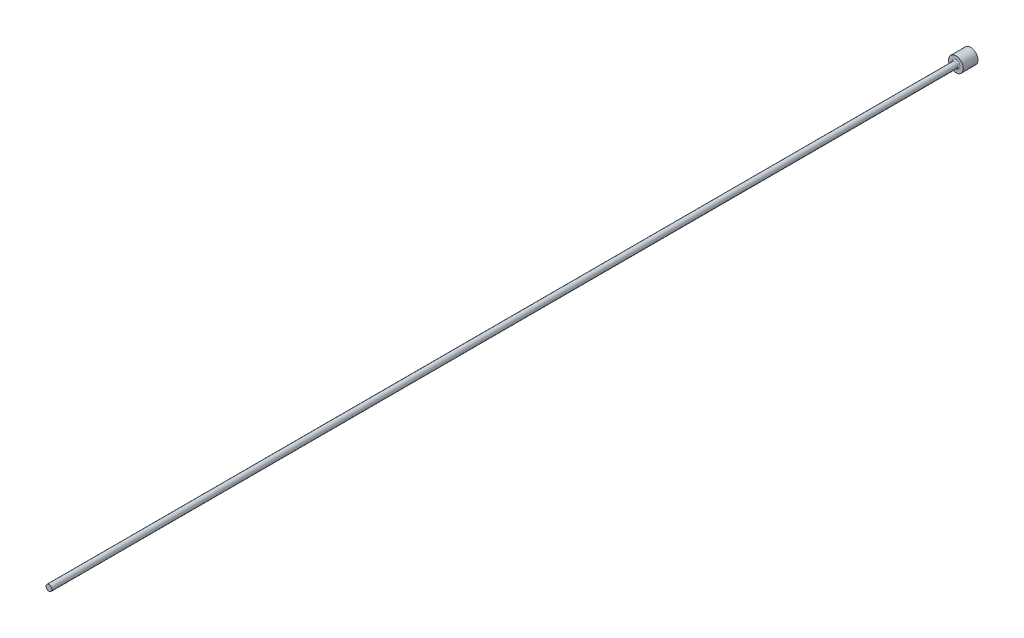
ISO-10303-21;
HEADER;
FILE_DESCRIPTION(('STEP AP214'),'2;1');
FILE_NAME('part.step','',(''),(''),'','','');
FILE_SCHEMA(('AUTOMOTIVE_DESIGN { 1 0 10303 214 1 1 1 1 }'));
ENDSEC;
DATA;
#1=APPLICATION_CONTEXT('core data for automotive mechanical design processes');
#2=APPLICATION_PROTOCOL_DEFINITION('international standard','automotive_design',2000,#1);
#3=PRODUCT_CONTEXT('',#1,'mechanical');
#4=PRODUCT('Part','Part','',(#3));
#5=PRODUCT_RELATED_PRODUCT_CATEGORY('part','',(#4));
#6=PRODUCT_DEFINITION_FORMATION('','',#4);
#7=PRODUCT_DEFINITION_CONTEXT('part definition',#1,'design');
#8=PRODUCT_DEFINITION('design','',#6,#7);
#9=PRODUCT_DEFINITION_SHAPE('','',#8);
#10=(LENGTH_UNIT() NAMED_UNIT(*) SI_UNIT(.MILLI.,.METRE.));
#11=(NAMED_UNIT(*) PLANE_ANGLE_UNIT() SI_UNIT($,.RADIAN.));
#12=(NAMED_UNIT(*) SI_UNIT($,.STERADIAN.) SOLID_ANGLE_UNIT());
#13=UNCERTAINTY_MEASURE_WITH_UNIT(LENGTH_MEASURE(1.E-05),#10,'distance_accuracy_value','');
#14=(GEOMETRIC_REPRESENTATION_CONTEXT(3) GLOBAL_UNCERTAINTY_ASSIGNED_CONTEXT((#13)) GLOBAL_UNIT_ASSIGNED_CONTEXT((#10,
#11,#12)) REPRESENTATION_CONTEXT('',''));
#15=CARTESIAN_POINT('',(0.,0.,0.));
#16=DIRECTION('',(0.,0.,1.));
#17=DIRECTION('',(1.,0.,0.));
#18=AXIS2_PLACEMENT_3D('',#15,#16,#17);
#19=CARTESIAN_POINT('',(2.,0.,4.));
#20=DIRECTION('',(0.,0.,-1.));
#21=DIRECTION('',(-1.,0.,0.));
#22=AXIS2_PLACEMENT_3D('',#19,#20,#21);
#23=PLANE('',#22);
#24=CARTESIAN_POINT('',(0.,0.,4.));
#25=DIRECTION('',(0.,0.,-1.));
#26=DIRECTION('',(-1.,0.,0.));
#27=AXIS2_PLACEMENT_3D('',#24,#25,#26);
#28=CIRCLE('',#27,1.10000000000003);
#29=CARTESIAN_POINT('',(-1.10000000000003,0.,4.));
#30=VERTEX_POINT('',#29);
#31=EDGE_CURVE('E40',#30,#30,#28,.T.);
#32=ORIENTED_EDGE('',*,*,#31,.T.);
#33=EDGE_LOOP('',(#32));
#34=FACE_BOUND('',#33,.T.);
#35=CARTESIAN_POINT('',(0.,0.,4.));
#36=DIRECTION('',(0.,0.,-1.));
#37=DIRECTION('',(-1.,0.,0.));
#38=AXIS2_PLACEMENT_3D('',#35,#36,#37);
#39=CIRCLE('',#38,2.);
#40=CARTESIAN_POINT('',(-2.,0.,4.));
#41=VERTEX_POINT('',#40);
#42=EDGE_CURVE('E44',#41,#41,#39,.T.);
#43=ORIENTED_EDGE('',*,*,#42,.F.);
#44=EDGE_LOOP('',(#43));
#45=FACE_BOUND('',#44,.T.);
#46=ADVANCED_FACE('F33',(#34,#45),#23,.F.);
#47=CARTESIAN_POINT('',(0.,0.,-9.03322817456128));
#48=DIRECTION('',(0.,0.,-1.));
#49=DIRECTION('',(-1.,0.,0.));
#50=AXIS2_PLACEMENT_3D('',#47,#48,#49);
#51=CYLINDRICAL_SURFACE('',#50,2.);
#52=CARTESIAN_POINT('',(0.,0.,0.));
#53=DIRECTION('',(0.,0.,-1.));
#54=DIRECTION('',(-1.,0.,0.));
#55=AXIS2_PLACEMENT_3D('',#52,#53,#54);
#56=CIRCLE('',#55,2.);
#57=CARTESIAN_POINT('',(-2.,0.,0.));
#58=VERTEX_POINT('',#57);
#59=EDGE_CURVE('E48',#58,#58,#56,.T.);
#60=ORIENTED_EDGE('',*,*,#59,.F.);
#61=EDGE_LOOP('',(#60));
#62=FACE_BOUND('',#61,.T.);
#63=ORIENTED_EDGE('',*,*,#42,.T.);
#64=EDGE_LOOP('',(#63));
#65=FACE_BOUND('',#64,.T.);
#66=ADVANCED_FACE('F68',(#62,#65),#51,.T.);
#67=CARTESIAN_POINT('',(0.,0.,0.));
#68=DIRECTION('',(0.,0.,1.));
#69=DIRECTION('',(1.,0.,0.));
#70=AXIS2_PLACEMENT_3D('',#67,#68,#69);
#71=PLANE('',#70);
#72=ORIENTED_EDGE('',*,*,#59,.T.);
#73=EDGE_LOOP('',(#72));
#74=FACE_BOUND('',#73,.T.);
#75=ADVANCED_FACE('F61',(#74),#71,.F.);
#76=CARTESIAN_POINT('',(0.,0.,250.));
#77=DIRECTION('',(0.,0.,-1.));
#78=DIRECTION('',(-1.,0.,0.));
#79=AXIS2_PLACEMENT_3D('',#76,#77,#78);
#80=PLANE('',#79);
#81=CARTESIAN_POINT('',(0.,0.,250.));
#82=DIRECTION('',(0.,0.,-1.));
#83=DIRECTION('',(-1.,0.,0.));
#84=AXIS2_PLACEMENT_3D('',#81,#82,#83);
#85=CIRCLE('',#84,0.800000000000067);
#86=CARTESIAN_POINT('',(-0.800000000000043,0.,250.));
#87=VERTEX_POINT('',#86);
#88=EDGE_CURVE('E53',#87,#87,#85,.T.);
#89=ORIENTED_EDGE('',*,*,#88,.F.);
#90=EDGE_LOOP('',(#89));
#91=FACE_BOUND('',#90,.T.);
#92=ADVANCED_FACE('F59',(#91),#80,.F.);
#93=CARTESIAN_POINT('',(0.,0.,-9.03322817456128));
#94=DIRECTION('',(0.,0.,-1.));
#95=DIRECTION('',(-1.,0.,0.));
#96=AXIS2_PLACEMENT_3D('',#93,#94,#95);
#97=CYLINDRICAL_SURFACE('',#96,0.800000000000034);
#98=CARTESIAN_POINT('',(0.,0.,4.3));
#99=DIRECTION('',(0.,0.,-1.));
#100=DIRECTION('',(-1.,0.,0.));
#101=AXIS2_PLACEMENT_3D('',#98,#99,#100);
#102=CIRCLE('',#101,0.800000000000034);
#103=CARTESIAN_POINT('',(-0.800000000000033,0.,4.3));
#104=VERTEX_POINT('',#103);
#105=EDGE_CURVE('E10',#104,#104,#102,.F.);
#106=ORIENTED_EDGE('',*,*,#105,.T.);
#107=EDGE_LOOP('',(#106));
#108=FACE_BOUND('',#107,.T.);
#109=ORIENTED_EDGE('',*,*,#88,.T.);
#110=EDGE_LOOP('',(#109));
#111=FACE_BOUND('',#110,.T.);
#112=ADVANCED_FACE('F57',(#108,#111),#97,.T.);
#113=CARTESIAN_POINT('',(0.,0.,4.3));
#114=DIRECTION('',(0.,0.,-1.));
#115=DIRECTION('',(-1.,0.,0.));
#116=AXIS2_PLACEMENT_3D('',#113,#114,#115);
#117=TOROIDAL_SURFACE('',#116,1.10000000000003,0.3);
#118=ORIENTED_EDGE('',*,*,#105,.F.);
#119=EDGE_LOOP('',(#118));
#120=FACE_BOUND('',#119,.T.);
#121=ORIENTED_EDGE('',*,*,#31,.F.);
#122=EDGE_LOOP('',(#121));
#123=FACE_BOUND('',#122,.T.);
#124=ADVANCED_FACE('F35',(#120,#123),#117,.F.);
#125=CLOSED_SHELL('',(#46,#66,#75,#92,#112,#124));
#126=MANIFOLD_SOLID_BREP('B2',#125);
#127=ADVANCED_BREP_SHAPE_REPRESENTATION('',(#18,#126),#14);
#128=SHAPE_DEFINITION_REPRESENTATION(#9,#127);
ENDSEC;
END-ISO-10303-21;
